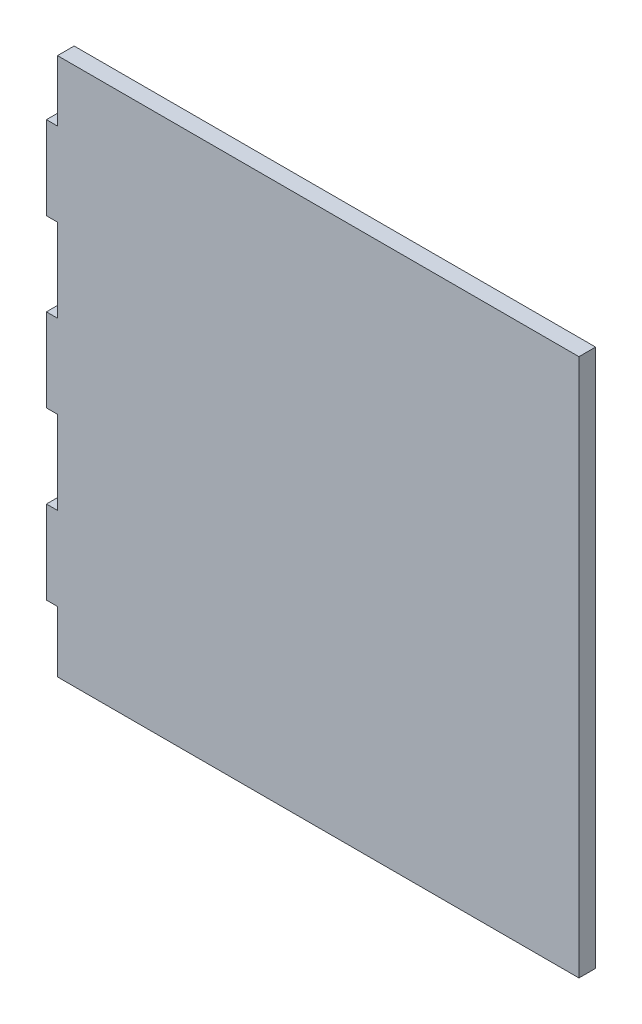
from build123d import *

# Parameters (mm, degrees)
SKETCH1_W           = 188
SKETCH1_H           = 194
SKETCH1_W_2         = 4
SKETCH1_H_2         = 30
BOSS_EXTRUDE1_DEPTH = 6


with BuildPart() as part:
    # Sketch1 → Boss-Extrude1 (new body)
    with BuildSketch(Plane.XY):
        with Locations((94, -97)):
            Rectangle(SKETCH1_W, SKETCH1_H)
        with Locations((-2, -37)):
            Rectangle(SKETCH1_W_2, SKETCH1_H_2)
        with Locations((-2, -157)):
            Rectangle(SKETCH1_W_2, SKETCH1_H_2)
        with Locations((-2, -97)):
            Rectangle(SKETCH1_W_2, SKETCH1_H_2)
    extrude(amount=BOSS_EXTRUDE1_DEPTH)


solid = part.part
